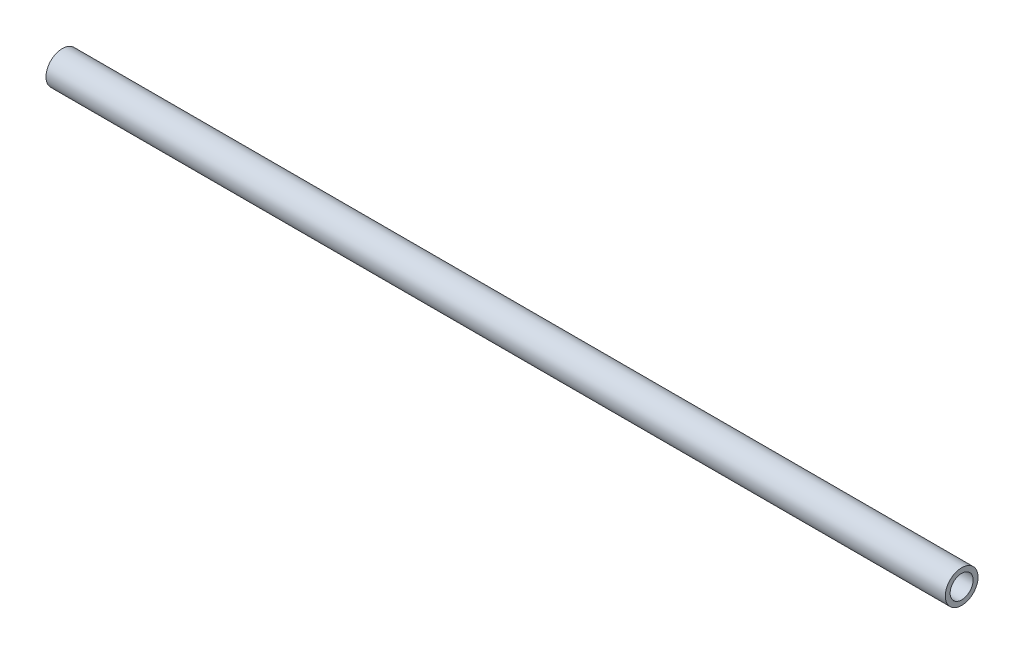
from build123d import *

# Parameters (mm, degrees)
SKETCH3_R           = 5.5499
SKETCH3_R_2         = 3.8989
BOSS_EXTRUDE1_DEPTH = 304.8


with BuildPart() as part:
    # Sketch3 → Boss-Extrude1 (new body)
    with BuildSketch(Plane(origin=(0, 0, 0), x_dir=(0, 0, -1), z_dir=(1, 0, 0))):
        with Locations(Location((0, 0, 0), (0, 0, 180))):
            Circle(SKETCH3_R)
        with Locations(Location((0, 0, 0), (0, 0, 180))):
            Circle(SKETCH3_R_2, mode=Mode.SUBTRACT)
    extrude(amount=BOSS_EXTRUDE1_DEPTH)


solid = part.part
